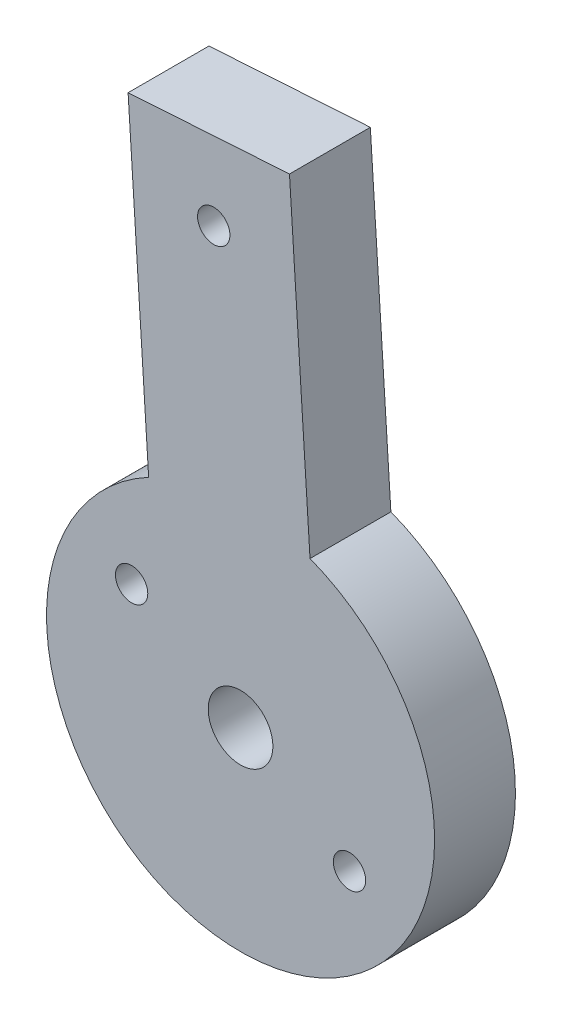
from build123d import *

# Parameters (mm, degrees)
BOSS_EXTRUDE1_DEPTH = 5
SKETCH2_R           = 2
SKETCH2_R_2         = 1
CUT_EXTRUDE1_DEPTH  = 5
SKETCH3_R           = 1
CUT_EXTRUDE2_DEPTH  = 5


with BuildPart() as part:
    # Sketch1 → Boss-Extrude1 (new body)
    with BuildSketch(Plane.XY):
        with BuildLine():
            Line((-5.683097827, 10.56893557), (-6.954014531, 30.528513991))
            Line((-6.954014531, 30.528513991), (3.02577468, 31.163972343))
            Line((3.02577468, 31.163972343), (4.296691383, 11.204393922))
            ThreePointArc((4.296691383, 11.204393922), (0.762550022, -11.975747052), (-5.683097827, 10.56893557))
        make_face()
    extrude(amount=BOSS_EXTRUDE1_DEPTH)

    # Sketch2 → Cut-Extrude1 (cut)
    with BuildSketch(Plane.XY.offset(5)):
        Circle(SKETCH2_R)
        with Locations((-1.658418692, 26.045245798)):
            Circle(SKETCH2_R_2)
    extrude(amount=-CUT_EXTRUDE1_DEPTH, mode=Mode.SUBTRACT)

    # Sketch3 → Cut-Extrude2 (cut)
    with BuildSketch(Plane.XY.offset(5)):
        with Locations((6.737030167, -4.314211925)):
            Circle(SKETCH3_R)
        with Locations((-6.737030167, 4.314211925)):
            Circle(SKETCH3_R)
    extrude(amount=-CUT_EXTRUDE2_DEPTH, mode=Mode.SUBTRACT)


solid = part.part
